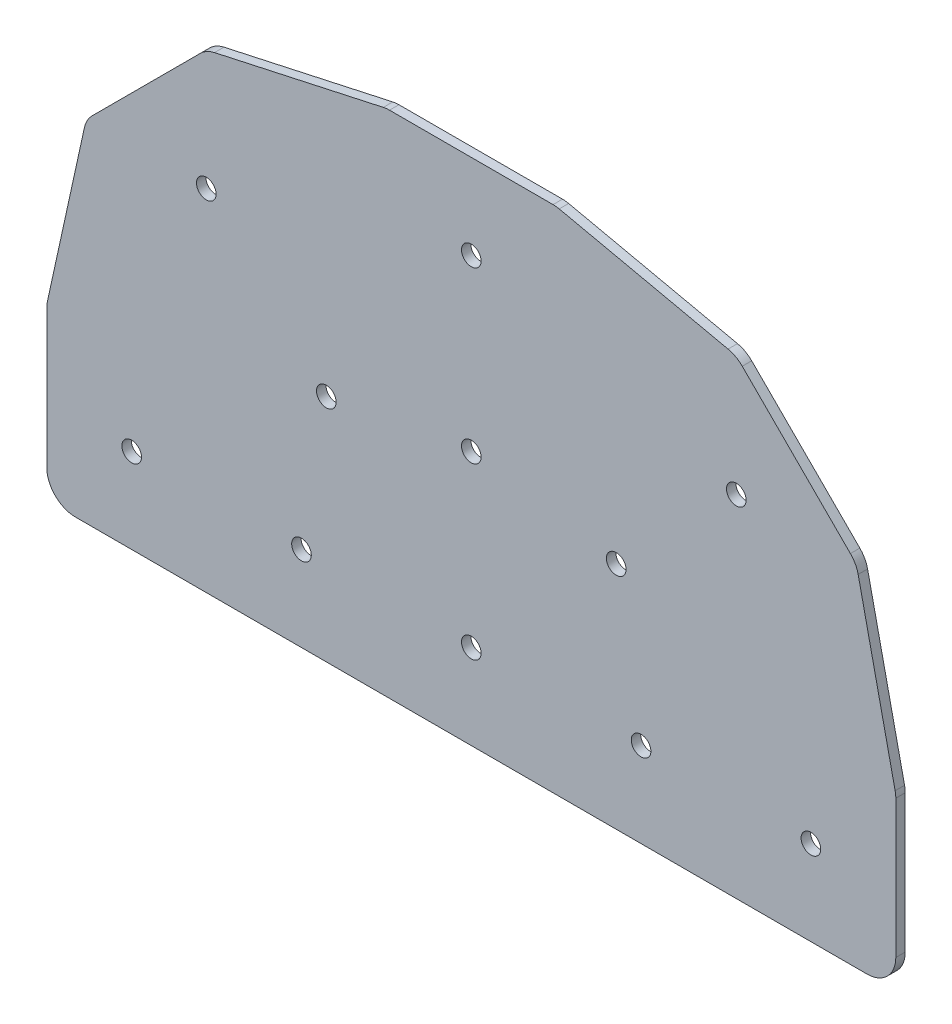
ISO-10303-21;
HEADER;
FILE_DESCRIPTION(('STEP AP214'),'2;1');
FILE_NAME('part.step','',(''),(''),'','','');
FILE_SCHEMA(('AUTOMOTIVE_DESIGN { 1 0 10303 214 1 1 1 1 }'));
ENDSEC;
DATA;
#1=APPLICATION_CONTEXT('core data for automotive mechanical design processes');
#2=APPLICATION_PROTOCOL_DEFINITION('international standard','automotive_design',2000,#1);
#3=PRODUCT_CONTEXT('',#1,'mechanical');
#4=PRODUCT('Part','Part','',(#3));
#5=PRODUCT_RELATED_PRODUCT_CATEGORY('part','',(#4));
#6=PRODUCT_DEFINITION_FORMATION('','',#4);
#7=PRODUCT_DEFINITION_CONTEXT('part definition',#1,'design');
#8=PRODUCT_DEFINITION('design','',#6,#7);
#9=PRODUCT_DEFINITION_SHAPE('','',#8);
#10=(LENGTH_UNIT() NAMED_UNIT(*) SI_UNIT(.MILLI.,.METRE.));
#11=(NAMED_UNIT(*) PLANE_ANGLE_UNIT() SI_UNIT($,.RADIAN.));
#12=(NAMED_UNIT(*) SI_UNIT($,.STERADIAN.) SOLID_ANGLE_UNIT());
#13=UNCERTAINTY_MEASURE_WITH_UNIT(LENGTH_MEASURE(1.E-05),#10,'distance_accuracy_value','');
#14=(GEOMETRIC_REPRESENTATION_CONTEXT(3) GLOBAL_UNCERTAINTY_ASSIGNED_CONTEXT((#13)) GLOBAL_UNIT_ASSIGNED_CONTEXT((#10,
#11,#12)) REPRESENTATION_CONTEXT('',''));
#15=CARTESIAN_POINT('',(0.,0.,0.));
#16=DIRECTION('',(0.,0.,1.));
#17=DIRECTION('',(1.,0.,0.));
#18=AXIS2_PLACEMENT_3D('',#15,#16,#17);
#19=CARTESIAN_POINT('',(-66.595625,0.,0.));
#20=DIRECTION('',(0.,1.,0.));
#21=DIRECTION('',(0.,0.,1.));
#22=AXIS2_PLACEMENT_3D('',#19,#20,#21);
#23=PLANE('',#22);
#24=DIRECTION('',(0.,0.,-1.));
#25=VECTOR('',#24,1.);
#26=CARTESIAN_POINT('',(66.5956250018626,0.,0.79375));
#27=LINE('',#26,#25);
#28=CARTESIAN_POINT('',(66.5956250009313,0.,0.));
#29=VERTEX_POINT('',#28);
#30=CARTESIAN_POINT('',(66.5956250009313,0.,1.5875));
#31=VERTEX_POINT('',#30);
#32=EDGE_CURVE('E231',#29,#31,#27,.F.);
#33=ORIENTED_EDGE('',*,*,#32,.T.);
#34=DIRECTION('',(1.,0.,0.));
#35=VECTOR('',#34,1.);
#36=CARTESIAN_POINT('',(0.,0.,1.5875));
#37=LINE('',#36,#35);
#38=CARTESIAN_POINT('',(-66.5956249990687,0.,1.5875));
#39=VERTEX_POINT('',#38);
#40=EDGE_CURVE('E299',#39,#31,#37,.T.);
#41=ORIENTED_EDGE('',*,*,#40,.F.);
#42=DIRECTION('',(0.,0.,1.));
#43=VECTOR('',#42,1.);
#44=CARTESIAN_POINT('',(-66.5956249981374,0.,0.79375));
#45=LINE('',#44,#43);
#46=CARTESIAN_POINT('',(-66.5956249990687,0.,0.));
#47=VERTEX_POINT('',#46);
#48=EDGE_CURVE('E177',#39,#47,#45,.F.);
#49=ORIENTED_EDGE('',*,*,#48,.T.);
#50=DIRECTION('',(1.,0.,0.));
#51=VECTOR('',#50,1.);
#52=CARTESIAN_POINT('',(0.,0.,0.));
#53=LINE('',#52,#51);
#54=EDGE_CURVE('E334',#47,#29,#53,.T.);
#55=ORIENTED_EDGE('',*,*,#54,.T.);
#56=EDGE_LOOP('',(#33,#41,#49,#55));
#57=FACE_BOUND('',#56,.T.);
#58=ADVANCED_FACE('F15',(#57),#23,.F.);
#59=CARTESIAN_POINT('',(66.595625,4.841875,1.5875));
#60=DIRECTION('',(0.,0.,-1.));
#61=DIRECTION('',(0.,1.,0.));
#62=AXIS2_PLACEMENT_3D('',#59,#60,#61);
#63=CYLINDRICAL_SURFACE('',#62,4.84187500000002);
#64=ORIENTED_EDGE('',*,*,#32,.F.);
#65=CARTESIAN_POINT('',(66.595625,4.841875,0.));
#66=DIRECTION('',(0.,0.,-1.));
#67=DIRECTION('',(0.,1.,0.));
#68=AXIS2_PLACEMENT_3D('',#65,#66,#67);
#69=CIRCLE('',#68,4.84187500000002);
#70=CARTESIAN_POINT('',(71.4375,4.841875,0.));
#71=VERTEX_POINT('',#70);
#72=EDGE_CURVE('E331',#29,#71,#69,.F.);
#73=ORIENTED_EDGE('',*,*,#72,.T.);
#74=DIRECTION('',(0.,0.,1.));
#75=VECTOR('',#74,1.);
#76=CARTESIAN_POINT('',(71.4375,4.841875,0.79375));
#77=LINE('',#76,#75);
#78=CARTESIAN_POINT('',(71.4375,4.841875,1.5875));
#79=VERTEX_POINT('',#78);
#80=EDGE_CURVE('E228',#71,#79,#77,.T.);
#81=ORIENTED_EDGE('',*,*,#80,.T.);
#82=CARTESIAN_POINT('',(66.595625,4.841875,1.5875));
#83=DIRECTION('',(0.,0.,-1.));
#84=DIRECTION('',(0.,1.,0.));
#85=AXIS2_PLACEMENT_3D('',#82,#83,#84);
#86=CIRCLE('',#85,4.84187500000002);
#87=EDGE_CURVE('E297',#31,#79,#86,.F.);
#88=ORIENTED_EDGE('',*,*,#87,.F.);
#89=EDGE_LOOP('',(#64,#73,#81,#88));
#90=FACE_BOUND('',#89,.T.);
#91=ADVANCED_FACE('F513',(#90),#63,.T.);
#92=CARTESIAN_POINT('',(71.4375,28.0511372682,0.));
#93=DIRECTION('',(-1.,0.,0.));
#94=DIRECTION('',(0.,-1.,0.));
#95=AXIS2_PLACEMENT_3D('',#92,#93,#94);
#96=PLANE('',#95);
#97=ORIENTED_EDGE('',*,*,#80,.F.);
#98=DIRECTION('',(0.,1.,0.));
#99=VECTOR('',#98,1.);
#100=CARTESIAN_POINT('',(71.4375,42.8625,0.));
#101=LINE('',#100,#99);
#102=CARTESIAN_POINT('',(71.4375,28.0511372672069,0.));
#103=VERTEX_POINT('',#102);
#104=EDGE_CURVE('E330',#71,#103,#101,.T.);
#105=ORIENTED_EDGE('',*,*,#104,.T.);
#106=DIRECTION('',(0.,0.,-1.));
#107=VECTOR('',#106,1.);
#108=CARTESIAN_POINT('',(71.4375,28.0511372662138,0.79375));
#109=LINE('',#108,#107);
#110=CARTESIAN_POINT('',(71.4375,28.0511372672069,1.5875));
#111=VERTEX_POINT('',#110);
#112=EDGE_CURVE('E151',#103,#111,#109,.F.);
#113=ORIENTED_EDGE('',*,*,#112,.T.);
#114=DIRECTION('',(0.,1.,0.));
#115=VECTOR('',#114,1.);
#116=CARTESIAN_POINT('',(71.4375,42.8625,1.5875));
#117=LINE('',#116,#115);
#118=EDGE_CURVE('E296',#79,#111,#117,.T.);
#119=ORIENTED_EDGE('',*,*,#118,.F.);
#120=EDGE_LOOP('',(#97,#105,#113,#119));
#121=FACE_BOUND('',#120,.T.);
#122=ADVANCED_FACE('F380',(#121),#96,.F.);
#123=CARTESIAN_POINT('',(66.595625,28.0511372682,1.5875));
#124=DIRECTION('',(0.,0.,-1.));
#125=DIRECTION('',(0.,1.,0.));
#126=AXIS2_PLACEMENT_3D('',#123,#124,#125);
#127=CYLINDRICAL_SURFACE('',#126,4.84187500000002);
#128=ORIENTED_EDGE('',*,*,#112,.F.);
#129=CARTESIAN_POINT('',(66.595625,28.0511372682,0.));
#130=DIRECTION('',(0.,0.,-1.));
#131=DIRECTION('',(0.,1.,0.));
#132=AXIS2_PLACEMENT_3D('',#129,#130,#131);
#133=CIRCLE('',#132,4.84187500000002);
#134=CARTESIAN_POINT('',(71.3254537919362,29.0867399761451,0.));
#135=VERTEX_POINT('',#134);
#136=EDGE_CURVE('E19',#103,#135,#133,.F.);
#137=ORIENTED_EDGE('',*,*,#136,.T.);
#138=DIRECTION('',(0.,0.,1.));
#139=VECTOR('',#138,1.);
#140=CARTESIAN_POINT('',(71.3254537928,29.0867399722,0.79375));
#141=LINE('',#140,#139);
#142=CARTESIAN_POINT('',(71.3254538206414,29.0867399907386,1.5875));
#143=VERTEX_POINT('',#142);
#144=EDGE_CURVE('E158',#135,#143,#141,.T.);
#145=ORIENTED_EDGE('',*,*,#144,.T.);
#146=CARTESIAN_POINT('',(66.595625,28.0511372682,1.5875));
#147=DIRECTION('',(0.,0.,-1.));
#148=DIRECTION('',(0.,1.,0.));
#149=AXIS2_PLACEMENT_3D('',#146,#147,#148);
#150=CIRCLE('',#149,4.84187500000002);
#151=EDGE_CURVE('E294',#111,#143,#150,.F.);
#152=ORIENTED_EDGE('',*,*,#151,.F.);
#153=EDGE_LOOP('',(#128,#137,#145,#152));
#154=FACE_BOUND('',#153,.T.);
#155=ADVANCED_FACE('F175',(#154),#127,.T.);
#156=CARTESIAN_POINT('',(65.1047616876,57.4980296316,0.));
#157=DIRECTION('',(-0.976858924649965,-0.213884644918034,0.));
#158=DIRECTION('',(0.213884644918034,-0.976858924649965,0.));
#159=AXIS2_PLACEMENT_3D('',#156,#157,#158);
#160=PLANE('',#159);
#161=ORIENTED_EDGE('',*,*,#144,.F.);
#162=DIRECTION('',(0.213884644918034,-0.976858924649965,0.));
#163=VECTOR('',#162,1.);
#164=CARTESIAN_POINT('',(65.1047616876,57.4980296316,0.));
#165=LINE('',#164,#163);
#166=CARTESIAN_POINT('',(65.1047616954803,57.4980296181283,0.));
#167=VERTEX_POINT('',#166);
#168=EDGE_CURVE('E162',#135,#167,#165,.F.);
#169=ORIENTED_EDGE('',*,*,#168,.T.);
#170=DIRECTION('',(0.,0.,-1.));
#171=VECTOR('',#170,1.);
#172=CARTESIAN_POINT('',(65.1047616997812,57.4980296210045,0.79375));
#173=LINE('',#172,#171);
#174=CARTESIAN_POINT('',(65.1047616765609,57.4980296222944,1.5875));
#175=VERTEX_POINT('',#174);
#176=EDGE_CURVE('E164',#167,#175,#173,.F.);
#177=ORIENTED_EDGE('',*,*,#176,.T.);
#178=DIRECTION('',(-0.213884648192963,0.976858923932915,0.));
#179=VECTOR('',#178,1.);
#180=CARTESIAN_POINT('',(71.325453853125,29.086739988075,1.5875));
#181=LINE('',#180,#179);
#182=EDGE_CURVE('E163',#143,#175,#181,.T.);
#183=ORIENTED_EDGE('',*,*,#182,.F.);
#184=EDGE_LOOP('',(#161,#169,#177,#183));
#185=FACE_BOUND('',#184,.T.);
#186=ADVANCED_FACE('F160',(#185),#160,.F.);
#187=CARTESIAN_POINT('',(60.3749328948,56.4624269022,1.5875));
#188=DIRECTION('',(0.,0.,-1.));
#189=DIRECTION('',(0.,1.,0.));
#190=AXIS2_PLACEMENT_3D('',#187,#188,#189);
#191=CYLINDRICAL_SURFACE('',#190,4.84187499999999);
#192=ORIENTED_EDGE('',*,*,#176,.F.);
#193=CARTESIAN_POINT('',(60.3749328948,56.4624269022,0.));
#194=DIRECTION('',(0.,0.,-1.));
#195=DIRECTION('',(0.,1.,0.));
#196=AXIS2_PLACEMENT_3D('',#193,#194,#195);
#197=CIRCLE('',#196,4.84187499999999);
#198=CARTESIAN_POINT('',(63.7986555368,59.8861495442,0.));
#199=VERTEX_POINT('',#198);
#200=EDGE_CURVE('E174',#167,#199,#197,.F.);
#201=ORIENTED_EDGE('',*,*,#200,.T.);
#202=DIRECTION('',(0.,0.,1.));
#203=VECTOR('',#202,1.);
#204=CARTESIAN_POINT('',(63.7986555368,59.8861495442,0.79375));
#205=LINE('',#204,#203);
#206=CARTESIAN_POINT('',(63.7986555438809,59.8861495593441,1.5875));
#207=VERTEX_POINT('',#206);
#208=EDGE_CURVE('E223',#199,#207,#205,.T.);
#209=ORIENTED_EDGE('',*,*,#208,.T.);
#210=CARTESIAN_POINT('',(60.3749328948,56.4624269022,1.5875));
#211=DIRECTION('',(0.,0.,-1.));
#212=DIRECTION('',(0.,1.,0.));
#213=AXIS2_PLACEMENT_3D('',#210,#211,#212);
#214=CIRCLE('',#213,4.84187499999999);
#215=EDGE_CURVE('E291',#175,#207,#214,.F.);
#216=ORIENTED_EDGE('',*,*,#215,.F.);
#217=EDGE_LOOP('',(#192,#201,#209,#216));
#218=FACE_BOUND('',#217,.T.);
#219=ADVANCED_FACE('F373',(#218),#191,.T.);
#220=CARTESIAN_POINT('',(45.5986495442,78.0861555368,0.));
#221=DIRECTION('',(-0.707106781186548,-0.707106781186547,0.));
#222=DIRECTION('',(0.707106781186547,-0.707106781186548,0.));
#223=AXIS2_PLACEMENT_3D('',#220,#221,#222);
#224=PLANE('',#223);
#225=ORIENTED_EDGE('',*,*,#208,.F.);
#226=DIRECTION('',(0.707106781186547,-0.707106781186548,0.));
#227=VECTOR('',#226,1.);
#228=CARTESIAN_POINT('',(45.5986495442,78.0861555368,0.));
#229=LINE('',#228,#227);
#230=CARTESIAN_POINT('',(45.5986495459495,78.0861555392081,0.));
#231=VERTEX_POINT('',#230);
#232=EDGE_CURVE('E369',#199,#231,#229,.F.);
#233=ORIENTED_EDGE('',*,*,#232,.T.);
#234=DIRECTION('',(0.,0.,-1.));
#235=VECTOR('',#234,1.);
#236=CARTESIAN_POINT('',(45.5986495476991,78.0861555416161,0.79375));
#237=LINE('',#236,#235);
#238=CARTESIAN_POINT('',(45.5986495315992,78.0861555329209,1.5875));
#239=VERTEX_POINT('',#238);
#240=EDGE_CURVE('E220',#231,#239,#237,.F.);
#241=ORIENTED_EDGE('',*,*,#240,.T.);
#242=DIRECTION('',(-0.707106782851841,0.707106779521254,0.));
#243=VECTOR('',#242,1.);
#244=CARTESIAN_POINT('',(63.7986555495,59.88614957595,1.5875));
#245=LINE('',#244,#243);
#246=EDGE_CURVE('E289',#207,#239,#245,.T.);
#247=ORIENTED_EDGE('',*,*,#246,.F.);
#248=EDGE_LOOP('',(#225,#233,#241,#247));
#249=FACE_BOUND('',#248,.T.);
#250=ADVANCED_FACE('F435',(#249),#224,.F.);
#251=CARTESIAN_POINT('',(42.1749269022,74.6624328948,1.5875));
#252=DIRECTION('',(0.,0.,-1.));
#253=DIRECTION('',(0.,1.,0.));
#254=AXIS2_PLACEMENT_3D('',#251,#252,#253);
#255=CYLINDRICAL_SURFACE('',#254,4.841875);
#256=ORIENTED_EDGE('',*,*,#240,.F.);
#257=CARTESIAN_POINT('',(42.1749269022,74.6624328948,0.));
#258=DIRECTION('',(0.,0.,-1.));
#259=DIRECTION('',(0.,1.,0.));
#260=AXIS2_PLACEMENT_3D('',#257,#258,#259);
#261=CIRCLE('',#260,4.841875);
#262=CARTESIAN_POINT('',(43.2105296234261,79.3922616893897,0.));
#263=VERTEX_POINT('',#262);
#264=EDGE_CURVE('E366',#231,#263,#261,.F.);
#265=ORIENTED_EDGE('',*,*,#264,.T.);
#266=DIRECTION('',(0.,0.,1.));
#267=VECTOR('',#266,1.);
#268=CARTESIAN_POINT('',(43.2105296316,79.3922616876,0.79375));
#269=LINE('',#268,#267);
#270=CARTESIAN_POINT('',(43.2105296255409,79.3922616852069,1.5875));
#271=VERTEX_POINT('',#270);
#272=EDGE_CURVE('E217',#263,#271,#269,.T.);
#273=ORIENTED_EDGE('',*,*,#272,.T.);
#274=CARTESIAN_POINT('',(42.1749269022,74.6624328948,1.5875));
#275=DIRECTION('',(0.,0.,-1.));
#276=DIRECTION('',(0.,1.,0.));
#277=AXIS2_PLACEMENT_3D('',#274,#275,#276);
#278=CIRCLE('',#277,4.841875);
#279=EDGE_CURVE('E287',#239,#271,#278,.F.);
#280=ORIENTED_EDGE('',*,*,#279,.F.);
#281=EDGE_LOOP('',(#256,#265,#273,#280));
#282=FACE_BOUND('',#281,.T.);
#283=ADVANCED_FACE('F432',(#282),#255,.T.);
#284=CARTESIAN_POINT('',(14.7992399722,85.6129537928,0.));
#285=DIRECTION('',(-0.213884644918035,-0.976858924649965,0.));
#286=DIRECTION('',(0.976858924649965,-0.213884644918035,0.));
#287=AXIS2_PLACEMENT_3D('',#284,#285,#286);
#288=PLANE('',#287);
#289=ORIENTED_EDGE('',*,*,#272,.F.);
#290=DIRECTION('',(0.976858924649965,-0.213884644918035,0.));
#291=VECTOR('',#290,1.);
#292=CARTESIAN_POINT('',(14.7992399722,85.6129537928,0.));
#293=LINE('',#292,#291);
#294=CARTESIAN_POINT('',(14.7992399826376,85.612953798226,0.));
#295=VERTEX_POINT('',#294);
#296=EDGE_CURVE('E363',#263,#295,#293,.F.);
#297=ORIENTED_EDGE('',*,*,#296,.T.);
#298=DIRECTION('',(0.,0.,-1.));
#299=VECTOR('',#298,1.);
#300=CARTESIAN_POINT('',(14.799239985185,85.6129538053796,0.79375));
#301=LINE('',#300,#299);
#302=CARTESIAN_POINT('',(14.7992399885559,85.6129538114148,1.5875));
#303=VERTEX_POINT('',#302);
#304=EDGE_CURVE('E214',#295,#303,#301,.F.);
#305=ORIENTED_EDGE('',*,*,#304,.T.);
#306=DIRECTION('',(-0.976858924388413,0.213884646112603,0.));
#307=VECTOR('',#306,1.);
#308=CARTESIAN_POINT('',(43.210529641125,79.392261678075,1.5875));
#309=LINE('',#308,#307);
#310=EDGE_CURVE('E285',#271,#303,#309,.T.);
#311=ORIENTED_EDGE('',*,*,#310,.F.);
#312=EDGE_LOOP('',(#289,#297,#305,#311));
#313=FACE_BOUND('',#312,.T.);
#314=ADVANCED_FACE('F429',(#313),#288,.F.);
#315=CARTESIAN_POINT('',(13.7636372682,80.883125,1.5875));
#316=DIRECTION('',(0.,0.,-1.));
#317=DIRECTION('',(0.,1.,0.));
#318=AXIS2_PLACEMENT_3D('',#315,#316,#317);
#319=CYLINDRICAL_SURFACE('',#318,4.841875);
#320=ORIENTED_EDGE('',*,*,#304,.F.);
#321=CARTESIAN_POINT('',(13.7636372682,80.883125,0.));
#322=DIRECTION('',(0.,0.,-1.));
#323=DIRECTION('',(0.,1.,0.));
#324=AXIS2_PLACEMENT_3D('',#321,#322,#323);
#325=CIRCLE('',#324,4.841875);
#326=CARTESIAN_POINT('',(13.7636372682,85.725,0.));
#327=VERTEX_POINT('',#326);
#328=EDGE_CURVE('E360',#295,#327,#325,.F.);
#329=ORIENTED_EDGE('',*,*,#328,.T.);
#330=DIRECTION('',(0.,0.,1.));
#331=VECTOR('',#330,1.);
#332=CARTESIAN_POINT('',(13.7636372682,85.725,0.79375));
#333=LINE('',#332,#331);
#334=CARTESIAN_POINT('',(13.7636372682,85.725,1.5875));
#335=VERTEX_POINT('',#334);
#336=EDGE_CURVE('E211',#327,#335,#333,.T.);
#337=ORIENTED_EDGE('',*,*,#336,.T.);
#338=CARTESIAN_POINT('',(13.7636372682,80.883125,1.5875));
#339=DIRECTION('',(0.,0.,-1.));
#340=DIRECTION('',(0.,1.,0.));
#341=AXIS2_PLACEMENT_3D('',#338,#339,#340);
#342=CIRCLE('',#341,4.841875);
#343=EDGE_CURVE('E283',#303,#335,#342,.F.);
#344=ORIENTED_EDGE('',*,*,#343,.F.);
#345=EDGE_LOOP('',(#320,#329,#337,#344));
#346=FACE_BOUND('',#345,.T.);
#347=ADVANCED_FACE('F425',(#346),#319,.T.);
#348=CARTESIAN_POINT('',(-13.7636372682,85.725,0.));
#349=DIRECTION('',(0.,-1.,0.));
#350=DIRECTION('',(1.,0.,0.));
#351=AXIS2_PLACEMENT_3D('',#348,#349,#350);
#352=PLANE('',#351);
#353=ORIENTED_EDGE('',*,*,#336,.F.);
#354=DIRECTION('',(-1.,0.,0.));
#355=VECTOR('',#354,1.);
#356=CARTESIAN_POINT('',(0.,85.725,0.));
#357=LINE('',#356,#355);
#358=CARTESIAN_POINT('',(-13.7636372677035,85.725,0.));
#359=VERTEX_POINT('',#358);
#360=EDGE_CURVE('E185',#327,#359,#357,.T.);
#361=ORIENTED_EDGE('',*,*,#360,.T.);
#362=DIRECTION('',(0.,0.,-1.));
#363=VECTOR('',#362,1.);
#364=CARTESIAN_POINT('',(-13.7636372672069,85.725,0.79375));
#365=LINE('',#364,#363);
#366=CARTESIAN_POINT('',(-13.7636372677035,85.725,1.5875));
#367=VERTEX_POINT('',#366);
#368=EDGE_CURVE('E208',#359,#367,#365,.F.);
#369=ORIENTED_EDGE('',*,*,#368,.T.);
#370=DIRECTION('',(-1.,0.,0.));
#371=VECTOR('',#370,1.);
#372=CARTESIAN_POINT('',(0.,85.725,1.5875));
#373=LINE('',#372,#371);
#374=EDGE_CURVE('E282',#335,#367,#373,.T.);
#375=ORIENTED_EDGE('',*,*,#374,.F.);
#376=EDGE_LOOP('',(#353,#361,#369,#375));
#377=FACE_BOUND('',#376,.T.);
#378=ADVANCED_FACE('F421',(#377),#352,.F.);
#379=CARTESIAN_POINT('',(-13.7636372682,80.883125,1.5875));
#380=DIRECTION('',(0.,0.,-1.));
#381=DIRECTION('',(0.,1.,0.));
#382=AXIS2_PLACEMENT_3D('',#379,#380,#381);
#383=CYLINDRICAL_SURFACE('',#382,4.841875);
#384=ORIENTED_EDGE('',*,*,#368,.F.);
#385=CARTESIAN_POINT('',(-13.7636372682,80.883125,0.));
#386=DIRECTION('',(0.,0.,-1.));
#387=DIRECTION('',(0.,1.,0.));
#388=AXIS2_PLACEMENT_3D('',#385,#386,#387);
#389=CIRCLE('',#388,4.841875);
#390=CARTESIAN_POINT('',(-14.7992399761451,85.6129537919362,0.));
#391=VERTEX_POINT('',#390);
#392=EDGE_CURVE('E357',#359,#391,#389,.F.);
#393=ORIENTED_EDGE('',*,*,#392,.T.);
#394=DIRECTION('',(0.,0.,1.));
#395=VECTOR('',#394,1.);
#396=CARTESIAN_POINT('',(-14.7992399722,85.6129537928,0.79375));
#397=LINE('',#396,#395);
#398=CARTESIAN_POINT('',(-14.7992399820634,85.6129538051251,1.5875));
#399=VERTEX_POINT('',#398);
#400=EDGE_CURVE('E205',#391,#399,#397,.T.);
#401=ORIENTED_EDGE('',*,*,#400,.T.);
#402=CARTESIAN_POINT('',(-13.7636372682,80.883125,1.5875));
#403=DIRECTION('',(0.,0.,-1.));
#404=DIRECTION('',(0.,1.,0.));
#405=AXIS2_PLACEMENT_3D('',#402,#403,#404);
#406=CIRCLE('',#405,4.841875);
#407=EDGE_CURVE('E280',#367,#399,#406,.F.);
#408=ORIENTED_EDGE('',*,*,#407,.F.);
#409=EDGE_LOOP('',(#384,#393,#401,#408));
#410=FACE_BOUND('',#409,.T.);
#411=ADVANCED_FACE('F417',(#410),#383,.T.);
#412=CARTESIAN_POINT('',(-43.2105296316,79.3922616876,0.));
#413=DIRECTION('',(0.213884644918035,-0.976858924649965,0.));
#414=DIRECTION('',(0.976858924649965,0.213884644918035,0.));
#415=AXIS2_PLACEMENT_3D('',#412,#413,#414);
#416=PLANE('',#415);
#417=ORIENTED_EDGE('',*,*,#400,.F.);
#418=DIRECTION('',(0.976858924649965,0.213884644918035,0.));
#419=VECTOR('',#418,1.);
#420=CARTESIAN_POINT('',(-43.2105296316,79.3922616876,0.));
#421=LINE('',#420,#419);
#422=CARTESIAN_POINT('',(-43.2105296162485,79.3922616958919,0.));
#423=VERTEX_POINT('',#422);
#424=EDGE_CURVE('E354',#391,#423,#421,.F.);
#425=ORIENTED_EDGE('',*,*,#424,.T.);
#426=DIRECTION('',(0.,0.,-1.));
#427=VECTOR('',#426,1.);
#428=CARTESIAN_POINT('',(-43.2105296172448,79.3922617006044,0.79375));
#429=LINE('',#428,#427);
#430=CARTESIAN_POINT('',(-43.2105296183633,79.3922616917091,1.5875));
#431=VERTEX_POINT('',#430);
#432=EDGE_CURVE('E202',#423,#431,#429,.F.);
#433=ORIENTED_EDGE('',*,*,#432,.T.);
#434=DIRECTION('',(-0.976858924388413,-0.213884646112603,0.));
#435=VECTOR('',#434,1.);
#436=CARTESIAN_POINT('',(-14.7992399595,85.61295382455,1.5875));
#437=LINE('',#436,#435);
#438=EDGE_CURVE('E278',#399,#431,#437,.T.);
#439=ORIENTED_EDGE('',*,*,#438,.F.);
#440=EDGE_LOOP('',(#417,#425,#433,#439));
#441=FACE_BOUND('',#440,.T.);
#442=ADVANCED_FACE('F412',(#441),#416,.F.);
#443=CARTESIAN_POINT('',(-42.1749269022,74.6624328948,1.5875));
#444=DIRECTION('',(0.,0.,-1.));
#445=DIRECTION('',(0.,1.,0.));
#446=AXIS2_PLACEMENT_3D('',#443,#444,#445);
#447=CYLINDRICAL_SURFACE('',#446,4.841875);
#448=ORIENTED_EDGE('',*,*,#432,.F.);
#449=CARTESIAN_POINT('',(-42.1749269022,74.6624328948,0.));
#450=DIRECTION('',(0.,0.,-1.));
#451=DIRECTION('',(0.,1.,0.));
#452=AXIS2_PLACEMENT_3D('',#449,#450,#451);
#453=CIRCLE('',#452,4.841875);
#454=CARTESIAN_POINT('',(-45.5986495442,78.0861555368,0.));
#455=VERTEX_POINT('',#454);
#456=EDGE_CURVE('E351',#423,#455,#453,.F.);
#457=ORIENTED_EDGE('',*,*,#456,.T.);
#458=DIRECTION('',(0.,0.,1.));
#459=VECTOR('',#458,1.);
#460=CARTESIAN_POINT('',(-45.5986495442,78.0861555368,0.79375));
#461=LINE('',#460,#459);
#462=CARTESIAN_POINT('',(-45.5986495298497,78.0861555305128,1.5875));
#463=VERTEX_POINT('',#462);
#464=EDGE_CURVE('E199',#455,#463,#461,.T.);
#465=ORIENTED_EDGE('',*,*,#464,.T.);
#466=CARTESIAN_POINT('',(-42.1749269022,74.6624328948,1.5875));
#467=DIRECTION('',(0.,0.,-1.));
#468=DIRECTION('',(0.,1.,0.));
#469=AXIS2_PLACEMENT_3D('',#466,#467,#468);
#470=CIRCLE('',#469,4.841875);
#471=EDGE_CURVE('E276',#431,#463,#470,.F.);
#472=ORIENTED_EDGE('',*,*,#471,.F.);
#473=EDGE_LOOP('',(#448,#457,#465,#472));
#474=FACE_BOUND('',#473,.T.);
#475=ADVANCED_FACE('F408',(#474),#447,.T.);
#476=CARTESIAN_POINT('',(-63.7986555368,59.8861495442,0.));
#477=DIRECTION('',(0.707106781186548,-0.707106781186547,0.));
#478=DIRECTION('',(0.707106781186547,0.707106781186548,0.));
#479=AXIS2_PLACEMENT_3D('',#476,#477,#478);
#480=PLANE('',#479);
#481=ORIENTED_EDGE('',*,*,#464,.F.);
#482=DIRECTION('',(0.707106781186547,0.707106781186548,0.));
#483=VECTOR('',#482,1.);
#484=CARTESIAN_POINT('',(-63.7986555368,59.8861495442,0.));
#485=LINE('',#484,#483);
#486=CARTESIAN_POINT('',(-63.7986555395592,59.8861495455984,0.));
#487=VERTEX_POINT('',#486);
#488=EDGE_CURVE('E348',#455,#487,#485,.F.);
#489=ORIENTED_EDGE('',*,*,#488,.T.);
#490=DIRECTION('',(0.,0.,-1.));
#491=VECTOR('',#490,1.);
#492=CARTESIAN_POINT('',(-63.7986555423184,59.8861495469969,0.79375));
#493=LINE('',#492,#491);
#494=CARTESIAN_POINT('',(-63.7986555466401,59.8861495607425,1.5875));
#495=VERTEX_POINT('',#494);
#496=EDGE_CURVE('E196',#487,#495,#493,.F.);
#497=ORIENTED_EDGE('',*,*,#496,.T.);
#498=DIRECTION('',(-0.707106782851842,-0.707106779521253,0.));
#499=VECTOR('',#498,1.);
#500=CARTESIAN_POINT('',(-45.598649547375,78.08615549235,1.5875));
#501=LINE('',#500,#499);
#502=EDGE_CURVE('E274',#463,#495,#501,.T.);
#503=ORIENTED_EDGE('',*,*,#502,.F.);
#504=EDGE_LOOP('',(#481,#489,#497,#503));
#505=FACE_BOUND('',#504,.T.);
#506=ADVANCED_FACE('F404',(#505),#480,.F.);
#507=CARTESIAN_POINT('',(-60.3749328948,56.4624269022,1.5875));
#508=DIRECTION('',(0.,0.,-1.));
#509=DIRECTION('',(0.,1.,0.));
#510=AXIS2_PLACEMENT_3D('',#507,#508,#509);
#511=CYLINDRICAL_SURFACE('',#510,4.84187500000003);
#512=ORIENTED_EDGE('',*,*,#496,.F.);
#513=CARTESIAN_POINT('',(-60.3749328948,56.4624269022,0.));
#514=DIRECTION('',(0.,0.,-1.));
#515=DIRECTION('',(0.,1.,0.));
#516=AXIS2_PLACEMENT_3D('',#513,#514,#515);
#517=CIRCLE('',#516,4.84187500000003);
#518=CARTESIAN_POINT('',(-65.1047616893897,57.4980296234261,0.));
#519=VERTEX_POINT('',#518);
#520=EDGE_CURVE('E345',#487,#519,#517,.F.);
#521=ORIENTED_EDGE('',*,*,#520,.T.);
#522=DIRECTION('',(0.,0.,1.));
#523=VECTOR('',#522,1.);
#524=CARTESIAN_POINT('',(-65.1047616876,57.4980296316,0.79375));
#525=LINE('',#524,#523);
#526=CARTESIAN_POINT('',(-65.1047616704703,57.4980296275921,1.5875));
#527=VERTEX_POINT('',#526);
#528=EDGE_CURVE('E193',#519,#527,#525,.T.);
#529=ORIENTED_EDGE('',*,*,#528,.T.);
#530=CARTESIAN_POINT('',(-60.3749328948,56.4624269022,1.5875));
#531=DIRECTION('',(0.,0.,-1.));
#532=DIRECTION('',(0.,1.,0.));
#533=AXIS2_PLACEMENT_3D('',#530,#531,#532);
#534=CIRCLE('',#533,4.84187500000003);
#535=EDGE_CURVE('E272',#495,#527,#534,.F.);
#536=ORIENTED_EDGE('',*,*,#535,.F.);
#537=EDGE_LOOP('',(#512,#521,#529,#536));
#538=FACE_BOUND('',#537,.T.);
#539=ADVANCED_FACE('F400',(#538),#511,.T.);
#540=CARTESIAN_POINT('',(-71.3254537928,29.0867399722,0.));
#541=DIRECTION('',(0.976858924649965,-0.213884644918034,0.));
#542=DIRECTION('',(0.213884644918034,0.976858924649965,0.));
#543=AXIS2_PLACEMENT_3D('',#540,#541,#542);
#544=PLANE('',#543);
#545=ORIENTED_EDGE('',*,*,#528,.F.);
#546=DIRECTION('',(0.213884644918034,0.976858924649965,0.));
#547=VECTOR('',#546,1.);
#548=CARTESIAN_POINT('',(-71.3254537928,29.0867399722,0.));
#549=LINE('',#548,#547);
#550=CARTESIAN_POINT('',(-71.3254537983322,29.0867399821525,0.));
#551=VERTEX_POINT('',#550);
#552=EDGE_CURVE('E342',#519,#551,#549,.F.);
#553=ORIENTED_EDGE('',*,*,#552,.T.);
#554=DIRECTION('',(0.,0.,-1.));
#555=VECTOR('',#554,1.);
#556=CARTESIAN_POINT('',(-71.325453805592,29.0867399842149,0.79375));
#557=LINE('',#556,#555);
#558=CARTESIAN_POINT('',(-71.3254538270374,29.0867399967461,1.5875));
#559=VERTEX_POINT('',#558);
#560=EDGE_CURVE('E190',#551,#559,#557,.F.);
#561=ORIENTED_EDGE('',*,*,#560,.T.);
#562=DIRECTION('',(-0.213884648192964,-0.976858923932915,0.));
#563=VECTOR('',#562,1.);
#564=CARTESIAN_POINT('',(-65.1047616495,57.498029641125,1.5875));
#565=LINE('',#564,#563);
#566=EDGE_CURVE('E270',#527,#559,#565,.T.);
#567=ORIENTED_EDGE('',*,*,#566,.F.);
#568=EDGE_LOOP('',(#545,#553,#561,#567));
#569=FACE_BOUND('',#568,.T.);
#570=ADVANCED_FACE('F396',(#569),#544,.F.);
#571=CARTESIAN_POINT('',(-66.595625,28.0511372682,1.5875));
#572=DIRECTION('',(0.,0.,-1.));
#573=DIRECTION('',(0.,1.,0.));
#574=AXIS2_PLACEMENT_3D('',#571,#572,#573);
#575=CYLINDRICAL_SURFACE('',#574,4.841875);
#576=ORIENTED_EDGE('',*,*,#560,.F.);
#577=CARTESIAN_POINT('',(-66.595625,28.0511372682,0.));
#578=DIRECTION('',(0.,0.,-1.));
#579=DIRECTION('',(0.,1.,0.));
#580=AXIS2_PLACEMENT_3D('',#577,#578,#579);
#581=CIRCLE('',#580,4.841875);
#582=CARTESIAN_POINT('',(-71.4375,28.0511372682,0.));
#583=VERTEX_POINT('',#582);
#584=EDGE_CURVE('E339',#551,#583,#581,.F.);
#585=ORIENTED_EDGE('',*,*,#584,.T.);
#586=DIRECTION('',(0.,0.,1.));
#587=VECTOR('',#586,1.);
#588=CARTESIAN_POINT('',(-71.4375,28.0511372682,0.79375));
#589=LINE('',#588,#587);
#590=CARTESIAN_POINT('',(-71.4375,28.0511372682,1.5875));
#591=VERTEX_POINT('',#590);
#592=EDGE_CURVE('E182',#583,#591,#589,.T.);
#593=ORIENTED_EDGE('',*,*,#592,.T.);
#594=CARTESIAN_POINT('',(-66.595625,28.0511372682,1.5875));
#595=DIRECTION('',(0.,0.,-1.));
#596=DIRECTION('',(0.,1.,0.));
#597=AXIS2_PLACEMENT_3D('',#594,#595,#596);
#598=CIRCLE('',#597,4.841875);
#599=EDGE_CURVE('E268',#559,#591,#598,.F.);
#600=ORIENTED_EDGE('',*,*,#599,.F.);
#601=EDGE_LOOP('',(#576,#585,#593,#600));
#602=FACE_BOUND('',#601,.T.);
#603=ADVANCED_FACE('F392',(#602),#575,.T.);
#604=CARTESIAN_POINT('',(-71.4375,4.841875,0.));
#605=DIRECTION('',(1.,0.,0.));
#606=DIRECTION('',(0.,1.,0.));
#607=AXIS2_PLACEMENT_3D('',#604,#605,#606);
#608=PLANE('',#607);
#609=ORIENTED_EDGE('',*,*,#592,.F.);
#610=DIRECTION('',(0.,-1.,0.));
#611=VECTOR('',#610,1.);
#612=CARTESIAN_POINT('',(-71.4375,42.8625,0.));
#613=LINE('',#612,#611);
#614=CARTESIAN_POINT('',(-71.4375,4.84187499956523,0.));
#615=VERTEX_POINT('',#614);
#616=EDGE_CURVE('E338',#583,#615,#613,.T.);
#617=ORIENTED_EDGE('',*,*,#616,.T.);
#618=DIRECTION('',(0.,0.,-1.));
#619=VECTOR('',#618,1.);
#620=CARTESIAN_POINT('',(-71.4375,4.84187499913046,0.79375));
#621=LINE('',#620,#619);
#622=CARTESIAN_POINT('',(-71.4375,4.84187499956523,1.5875));
#623=VERTEX_POINT('',#622);
#624=EDGE_CURVE('E176',#615,#623,#621,.F.);
#625=ORIENTED_EDGE('',*,*,#624,.T.);
#626=DIRECTION('',(0.,-1.,0.));
#627=VECTOR('',#626,1.);
#628=CARTESIAN_POINT('',(-71.4375,42.8625,1.5875));
#629=LINE('',#628,#627);
#630=EDGE_CURVE('E34',#591,#623,#629,.T.);
#631=ORIENTED_EDGE('',*,*,#630,.F.);
#632=EDGE_LOOP('',(#609,#617,#625,#631));
#633=FACE_BOUND('',#632,.T.);
#634=ADVANCED_FACE('F386',(#633),#608,.F.);
#635=CARTESIAN_POINT('',(-66.595625,4.841875,1.5875));
#636=DIRECTION('',(0.,0.,-1.));
#637=DIRECTION('',(0.,1.,0.));
#638=AXIS2_PLACEMENT_3D('',#635,#636,#637);
#639=CYLINDRICAL_SURFACE('',#638,4.841875);
#640=ORIENTED_EDGE('',*,*,#624,.F.);
#641=CARTESIAN_POINT('',(-66.595625,4.841875,0.));
#642=DIRECTION('',(0.,0.,-1.));
#643=DIRECTION('',(0.,1.,0.));
#644=AXIS2_PLACEMENT_3D('',#641,#642,#643);
#645=CIRCLE('',#644,4.841875);
#646=EDGE_CURVE('E335',#615,#47,#645,.F.);
#647=ORIENTED_EDGE('',*,*,#646,.T.);
#648=ORIENTED_EDGE('',*,*,#48,.F.);
#649=CARTESIAN_POINT('',(-66.595625,4.841875,1.5875));
#650=DIRECTION('',(0.,0.,-1.));
#651=DIRECTION('',(0.,1.,0.));
#652=AXIS2_PLACEMENT_3D('',#649,#650,#651);
#653=CIRCLE('',#652,4.841875);
#654=EDGE_CURVE('E266',#623,#39,#653,.F.);
#655=ORIENTED_EDGE('',*,*,#654,.F.);
#656=EDGE_LOOP('',(#640,#647,#648,#655));
#657=FACE_BOUND('',#656,.T.);
#658=ADVANCED_FACE('F496',(#657),#639,.T.);
#659=CARTESIAN_POINT('',(0.,71.4375,0.));
#660=DIRECTION('',(0.,0.,1.));
#661=DIRECTION('',(1.,0.,0.));
#662=AXIS2_PLACEMENT_3D('',#659,#660,#661);
#663=CYLINDRICAL_SURFACE('',#662,1.651);
#664=CARTESIAN_POINT('',(0.,71.4375,1.5875));
#665=DIRECTION('',(0.,0.,1.));
#666=DIRECTION('',(1.,0.,0.));
#667=AXIS2_PLACEMENT_3D('',#664,#665,#666);
#668=CIRCLE('',#667,1.651);
#669=CARTESIAN_POINT('',(1.651,71.4375,1.5875));
#670=VERTEX_POINT('',#669);
#671=EDGE_CURVE('E263',#670,#670,#668,.F.);
#672=ORIENTED_EDGE('',*,*,#671,.F.);
#673=EDGE_LOOP('',(#672));
#674=FACE_BOUND('',#673,.T.);
#675=CARTESIAN_POINT('',(0.,71.4375,0.));
#676=DIRECTION('',(0.,0.,1.));
#677=DIRECTION('',(1.,0.,0.));
#678=AXIS2_PLACEMENT_3D('',#675,#676,#677);
#679=CIRCLE('',#678,1.651);
#680=CARTESIAN_POINT('',(1.651,71.4375,0.));
#681=VERTEX_POINT('',#680);
#682=EDGE_CURVE('E327',#681,#681,#679,.F.);
#683=ORIENTED_EDGE('',*,*,#682,.T.);
#684=EDGE_LOOP('',(#683));
#685=FACE_BOUND('',#684,.T.);
#686=ADVANCED_FACE('F492',(#674,#685),#663,.F.);
#687=CARTESIAN_POINT('',(0.,42.8625,0.));
#688=DIRECTION('',(0.,0.,1.));
#689=DIRECTION('',(1.,0.,0.));
#690=AXIS2_PLACEMENT_3D('',#687,#688,#689);
#691=CYLINDRICAL_SURFACE('',#690,1.651);
#692=CARTESIAN_POINT('',(0.,42.8625,1.5875));
#693=DIRECTION('',(0.,0.,1.));
#694=DIRECTION('',(1.,0.,0.));
#695=AXIS2_PLACEMENT_3D('',#692,#693,#694);
#696=CIRCLE('',#695,1.651);
#697=CARTESIAN_POINT('',(1.651,42.8625,1.5875));
#698=VERTEX_POINT('',#697);
#699=EDGE_CURVE('E260',#698,#698,#696,.F.);
#700=ORIENTED_EDGE('',*,*,#699,.F.);
#701=EDGE_LOOP('',(#700));
#702=FACE_BOUND('',#701,.T.);
#703=CARTESIAN_POINT('',(0.,42.8625,0.));
#704=DIRECTION('',(0.,0.,1.));
#705=DIRECTION('',(1.,0.,0.));
#706=AXIS2_PLACEMENT_3D('',#703,#704,#705);
#707=CIRCLE('',#706,1.651);
#708=CARTESIAN_POINT('',(1.651,42.8625,0.));
#709=VERTEX_POINT('',#708);
#710=EDGE_CURVE('E324',#709,#709,#707,.F.);
#711=ORIENTED_EDGE('',*,*,#710,.T.);
#712=EDGE_LOOP('',(#711));
#713=FACE_BOUND('',#712,.T.);
#714=ADVANCED_FACE('F488',(#702,#713),#691,.F.);
#715=CARTESIAN_POINT('',(-57.15,14.2875,0.));
#716=DIRECTION('',(0.,0.,1.));
#717=DIRECTION('',(1.,0.,0.));
#718=AXIS2_PLACEMENT_3D('',#715,#716,#717);
#719=CYLINDRICAL_SURFACE('',#718,1.651);
#720=CARTESIAN_POINT('',(-57.15,14.2875,1.5875));
#721=DIRECTION('',(0.,0.,1.));
#722=DIRECTION('',(1.,0.,0.));
#723=AXIS2_PLACEMENT_3D('',#720,#721,#722);
#724=CIRCLE('',#723,1.651);
#725=CARTESIAN_POINT('',(-55.499,14.2875,1.5875));
#726=VERTEX_POINT('',#725);
#727=EDGE_CURVE('E257',#726,#726,#724,.F.);
#728=ORIENTED_EDGE('',*,*,#727,.F.);
#729=EDGE_LOOP('',(#728));
#730=FACE_BOUND('',#729,.T.);
#731=CARTESIAN_POINT('',(-57.15,14.2875,0.));
#732=DIRECTION('',(0.,0.,1.));
#733=DIRECTION('',(1.,0.,0.));
#734=AXIS2_PLACEMENT_3D('',#731,#732,#733);
#735=CIRCLE('',#734,1.651);
#736=CARTESIAN_POINT('',(-55.499,14.2875,0.));
#737=VERTEX_POINT('',#736);
#738=EDGE_CURVE('E321',#737,#737,#735,.F.);
#739=ORIENTED_EDGE('',*,*,#738,.T.);
#740=EDGE_LOOP('',(#739));
#741=FACE_BOUND('',#740,.T.);
#742=ADVANCED_FACE('F484',(#730,#741),#719,.F.);
#743=CARTESIAN_POINT('',(57.15,14.2875,0.));
#744=DIRECTION('',(0.,0.,1.));
#745=DIRECTION('',(1.,0.,0.));
#746=AXIS2_PLACEMENT_3D('',#743,#744,#745);
#747=CYLINDRICAL_SURFACE('',#746,1.65099999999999);
#748=CARTESIAN_POINT('',(57.15,14.2875,1.5875));
#749=DIRECTION('',(0.,0.,1.));
#750=DIRECTION('',(1.,0.,0.));
#751=AXIS2_PLACEMENT_3D('',#748,#749,#750);
#752=CIRCLE('',#751,1.65099999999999);
#753=CARTESIAN_POINT('',(58.801,14.2875,1.5875));
#754=VERTEX_POINT('',#753);
#755=EDGE_CURVE('E254',#754,#754,#752,.F.);
#756=ORIENTED_EDGE('',*,*,#755,.F.);
#757=EDGE_LOOP('',(#756));
#758=FACE_BOUND('',#757,.T.);
#759=CARTESIAN_POINT('',(57.15,14.2875,0.));
#760=DIRECTION('',(0.,0.,1.));
#761=DIRECTION('',(1.,0.,0.));
#762=AXIS2_PLACEMENT_3D('',#759,#760,#761);
#763=CIRCLE('',#762,1.65099999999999);
#764=CARTESIAN_POINT('',(58.801,14.2875,0.));
#765=VERTEX_POINT('',#764);
#766=EDGE_CURVE('E318',#765,#765,#763,.F.);
#767=ORIENTED_EDGE('',*,*,#766,.T.);
#768=EDGE_LOOP('',(#767));
#769=FACE_BOUND('',#768,.T.);
#770=ADVANCED_FACE('F480',(#758,#769),#747,.F.);
#771=CARTESIAN_POINT('',(44.5958644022,58.8833644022,0.));
#772=DIRECTION('',(0.,0.,1.));
#773=DIRECTION('',(1.,0.,0.));
#774=AXIS2_PLACEMENT_3D('',#771,#772,#773);
#775=CYLINDRICAL_SURFACE('',#774,1.651);
#776=CARTESIAN_POINT('',(44.5958644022,58.8833644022,1.5875));
#777=DIRECTION('',(0.,0.,1.));
#778=DIRECTION('',(1.,0.,0.));
#779=AXIS2_PLACEMENT_3D('',#776,#777,#778);
#780=CIRCLE('',#779,1.651);
#781=CARTESIAN_POINT('',(46.2468644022,58.8833644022,1.5875));
#782=VERTEX_POINT('',#781);
#783=EDGE_CURVE('E251',#782,#782,#780,.F.);
#784=ORIENTED_EDGE('',*,*,#783,.F.);
#785=EDGE_LOOP('',(#784));
#786=FACE_BOUND('',#785,.T.);
#787=CARTESIAN_POINT('',(44.5958644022,58.8833644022,0.));
#788=DIRECTION('',(0.,0.,1.));
#789=DIRECTION('',(1.,0.,0.));
#790=AXIS2_PLACEMENT_3D('',#787,#788,#789);
#791=CIRCLE('',#790,1.651);
#792=CARTESIAN_POINT('',(46.2468644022,58.8833644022,0.));
#793=VERTEX_POINT('',#792);
#794=EDGE_CURVE('E315',#793,#793,#791,.F.);
#795=ORIENTED_EDGE('',*,*,#794,.T.);
#796=EDGE_LOOP('',(#795));
#797=FACE_BOUND('',#796,.T.);
#798=ADVANCED_FACE('F476',(#786,#797),#775,.F.);
#799=CARTESIAN_POINT('',(24.3902881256,38.6777881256,0.));
#800=DIRECTION('',(0.,0.,1.));
#801=DIRECTION('',(1.,0.,0.));
#802=AXIS2_PLACEMENT_3D('',#799,#800,#801);
#803=CYLINDRICAL_SURFACE('',#802,1.65100000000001);
#804=CARTESIAN_POINT('',(24.3902881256,38.6777881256,1.5875));
#805=DIRECTION('',(0.,0.,1.));
#806=DIRECTION('',(1.,0.,0.));
#807=AXIS2_PLACEMENT_3D('',#804,#805,#806);
#808=CIRCLE('',#807,1.65100000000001);
#809=CARTESIAN_POINT('',(26.0412881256,38.6777881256,1.5875));
#810=VERTEX_POINT('',#809);
#811=EDGE_CURVE('E248',#810,#810,#808,.F.);
#812=ORIENTED_EDGE('',*,*,#811,.F.);
#813=EDGE_LOOP('',(#812));
#814=FACE_BOUND('',#813,.T.);
#815=CARTESIAN_POINT('',(24.3902881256,38.6777881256,0.));
#816=DIRECTION('',(0.,0.,1.));
#817=DIRECTION('',(1.,0.,0.));
#818=AXIS2_PLACEMENT_3D('',#815,#816,#817);
#819=CIRCLE('',#818,1.65100000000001);
#820=CARTESIAN_POINT('',(26.0412881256,38.6777881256,0.));
#821=VERTEX_POINT('',#820);
#822=EDGE_CURVE('E312',#821,#821,#819,.F.);
#823=ORIENTED_EDGE('',*,*,#822,.T.);
#824=EDGE_LOOP('',(#823));
#825=FACE_BOUND('',#824,.T.);
#826=ADVANCED_FACE('F472',(#814,#825),#803,.F.);
#827=CARTESIAN_POINT('',(-44.5958644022,58.8833644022,0.));
#828=DIRECTION('',(0.,0.,1.));
#829=DIRECTION('',(1.,0.,0.));
#830=AXIS2_PLACEMENT_3D('',#827,#828,#829);
#831=CYLINDRICAL_SURFACE('',#830,1.651);
#832=CARTESIAN_POINT('',(-44.5958644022,58.8833644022,1.5875));
#833=DIRECTION('',(0.,0.,1.));
#834=DIRECTION('',(1.,0.,0.));
#835=AXIS2_PLACEMENT_3D('',#832,#833,#834);
#836=CIRCLE('',#835,1.651);
#837=CARTESIAN_POINT('',(-42.9448644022,58.8833644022,1.5875));
#838=VERTEX_POINT('',#837);
#839=EDGE_CURVE('E245',#838,#838,#836,.F.);
#840=ORIENTED_EDGE('',*,*,#839,.F.);
#841=EDGE_LOOP('',(#840));
#842=FACE_BOUND('',#841,.T.);
#843=CARTESIAN_POINT('',(-44.5958644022,58.8833644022,0.));
#844=DIRECTION('',(0.,0.,1.));
#845=DIRECTION('',(1.,0.,0.));
#846=AXIS2_PLACEMENT_3D('',#843,#844,#845);
#847=CIRCLE('',#846,1.651);
#848=CARTESIAN_POINT('',(-42.9448644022,58.8833644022,0.));
#849=VERTEX_POINT('',#848);
#850=EDGE_CURVE('E309',#849,#849,#847,.F.);
#851=ORIENTED_EDGE('',*,*,#850,.T.);
#852=EDGE_LOOP('',(#851));
#853=FACE_BOUND('',#852,.T.);
#854=ADVANCED_FACE('F468',(#842,#853),#831,.F.);
#855=CARTESIAN_POINT('',(-24.3902881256,38.6777881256,0.));
#856=DIRECTION('',(0.,0.,1.));
#857=DIRECTION('',(1.,0.,0.));
#858=AXIS2_PLACEMENT_3D('',#855,#856,#857);
#859=CYLINDRICAL_SURFACE('',#858,1.651);
#860=CARTESIAN_POINT('',(-24.3902881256,38.6777881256,1.5875));
#861=DIRECTION('',(0.,0.,1.));
#862=DIRECTION('',(1.,0.,0.));
#863=AXIS2_PLACEMENT_3D('',#860,#861,#862);
#864=CIRCLE('',#863,1.651);
#865=CARTESIAN_POINT('',(-22.7392881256,38.6777881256,1.5875));
#866=VERTEX_POINT('',#865);
#867=EDGE_CURVE('E242',#866,#866,#864,.F.);
#868=ORIENTED_EDGE('',*,*,#867,.F.);
#869=EDGE_LOOP('',(#868));
#870=FACE_BOUND('',#869,.T.);
#871=CARTESIAN_POINT('',(-24.3902881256,38.6777881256,0.));
#872=DIRECTION('',(0.,0.,1.));
#873=DIRECTION('',(1.,0.,0.));
#874=AXIS2_PLACEMENT_3D('',#871,#872,#873);
#875=CIRCLE('',#874,1.651);
#876=CARTESIAN_POINT('',(-22.7392881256,38.6777881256,0.));
#877=VERTEX_POINT('',#876);
#878=EDGE_CURVE('E306',#877,#877,#875,.F.);
#879=ORIENTED_EDGE('',*,*,#878,.T.);
#880=EDGE_LOOP('',(#879));
#881=FACE_BOUND('',#880,.T.);
#882=ADVANCED_FACE('F464',(#870,#881),#859,.F.);
#883=CARTESIAN_POINT('',(-28.575,14.2875,0.));
#884=DIRECTION('',(0.,0.,1.));
#885=DIRECTION('',(1.,0.,0.));
#886=AXIS2_PLACEMENT_3D('',#883,#884,#885);
#887=CYLINDRICAL_SURFACE('',#886,1.651);
#888=CARTESIAN_POINT('',(-28.575,14.2875,1.5875));
#889=DIRECTION('',(0.,0.,1.));
#890=DIRECTION('',(1.,0.,0.));
#891=AXIS2_PLACEMENT_3D('',#888,#889,#890);
#892=CIRCLE('',#891,1.651);
#893=CARTESIAN_POINT('',(-26.924,14.2875,1.5875));
#894=VERTEX_POINT('',#893);
#895=EDGE_CURVE('E239',#894,#894,#892,.F.);
#896=ORIENTED_EDGE('',*,*,#895,.F.);
#897=EDGE_LOOP('',(#896));
#898=FACE_BOUND('',#897,.T.);
#899=CARTESIAN_POINT('',(-28.575,14.2875,0.));
#900=DIRECTION('',(0.,0.,1.));
#901=DIRECTION('',(1.,0.,0.));
#902=AXIS2_PLACEMENT_3D('',#899,#900,#901);
#903=CIRCLE('',#902,1.651);
#904=CARTESIAN_POINT('',(-26.924,14.2875,0.));
#905=VERTEX_POINT('',#904);
#906=EDGE_CURVE('E303',#905,#905,#903,.F.);
#907=ORIENTED_EDGE('',*,*,#906,.T.);
#908=EDGE_LOOP('',(#907));
#909=FACE_BOUND('',#908,.T.);
#910=ADVANCED_FACE('F460',(#898,#909),#887,.F.);
#911=CARTESIAN_POINT('',(28.575,14.2875,0.));
#912=DIRECTION('',(0.,0.,1.));
#913=DIRECTION('',(1.,0.,0.));
#914=AXIS2_PLACEMENT_3D('',#911,#912,#913);
#915=CYLINDRICAL_SURFACE('',#914,1.651);
#916=CARTESIAN_POINT('',(28.575,14.2875,1.5875));
#917=DIRECTION('',(0.,0.,1.));
#918=DIRECTION('',(1.,0.,0.));
#919=AXIS2_PLACEMENT_3D('',#916,#917,#918);
#920=CIRCLE('',#919,1.651);
#921=CARTESIAN_POINT('',(30.226,14.2875,1.5875));
#922=VERTEX_POINT('',#921);
#923=EDGE_CURVE('E236',#922,#922,#920,.F.);
#924=ORIENTED_EDGE('',*,*,#923,.F.);
#925=EDGE_LOOP('',(#924));
#926=FACE_BOUND('',#925,.T.);
#927=CARTESIAN_POINT('',(28.575,14.2875,0.));
#928=DIRECTION('',(0.,0.,1.));
#929=DIRECTION('',(1.,0.,0.));
#930=AXIS2_PLACEMENT_3D('',#927,#928,#929);
#931=CIRCLE('',#930,1.651);
#932=CARTESIAN_POINT('',(30.226,14.2875,0.));
#933=VERTEX_POINT('',#932);
#934=EDGE_CURVE('E300',#933,#933,#931,.F.);
#935=ORIENTED_EDGE('',*,*,#934,.T.);
#936=EDGE_LOOP('',(#935));
#937=FACE_BOUND('',#936,.T.);
#938=ADVANCED_FACE('F457',(#926,#937),#915,.F.);
#939=CARTESIAN_POINT('',(-71.4375,0.,0.));
#940=DIRECTION('',(0.,0.,1.));
#941=DIRECTION('',(1.,0.,0.));
#942=AXIS2_PLACEMENT_3D('',#939,#940,#941);
#943=PLANE('',#942);
#944=ORIENTED_EDGE('',*,*,#934,.F.);
#945=EDGE_LOOP('',(#944));
#946=FACE_BOUND('',#945,.T.);
#947=ORIENTED_EDGE('',*,*,#906,.F.);
#948=EDGE_LOOP('',(#947));
#949=FACE_BOUND('',#948,.T.);
#950=ORIENTED_EDGE('',*,*,#878,.F.);
#951=EDGE_LOOP('',(#950));
#952=FACE_BOUND('',#951,.T.);
#953=ORIENTED_EDGE('',*,*,#850,.F.);
#954=EDGE_LOOP('',(#953));
#955=FACE_BOUND('',#954,.T.);
#956=ORIENTED_EDGE('',*,*,#822,.F.);
#957=EDGE_LOOP('',(#956));
#958=FACE_BOUND('',#957,.T.);
#959=ORIENTED_EDGE('',*,*,#794,.F.);
#960=EDGE_LOOP('',(#959));
#961=FACE_BOUND('',#960,.T.);
#962=ORIENTED_EDGE('',*,*,#766,.F.);
#963=EDGE_LOOP('',(#962));
#964=FACE_BOUND('',#963,.T.);
#965=ORIENTED_EDGE('',*,*,#738,.F.);
#966=EDGE_LOOP('',(#965));
#967=FACE_BOUND('',#966,.T.);
#968=ORIENTED_EDGE('',*,*,#710,.F.);
#969=EDGE_LOOP('',(#968));
#970=FACE_BOUND('',#969,.T.);
#971=ORIENTED_EDGE('',*,*,#682,.F.);
#972=EDGE_LOOP('',(#971));
#973=FACE_BOUND('',#972,.T.);
#974=CARTESIAN_POINT('',(0.,14.2875,0.));
#975=DIRECTION('',(0.,0.,1.));
#976=DIRECTION('',(1.,0.,0.));
#977=AXIS2_PLACEMENT_3D('',#974,#975,#976);
#978=CIRCLE('',#977,1.651);
#979=CARTESIAN_POINT('',(1.651,14.2875,0.));
#980=VERTEX_POINT('',#979);
#981=EDGE_CURVE('E25',#980,#980,#978,.F.);
#982=ORIENTED_EDGE('',*,*,#981,.F.);
#983=EDGE_LOOP('',(#982));
#984=FACE_BOUND('',#983,.T.);
#985=ORIENTED_EDGE('',*,*,#72,.F.);
#986=ORIENTED_EDGE('',*,*,#54,.F.);
#987=ORIENTED_EDGE('',*,*,#646,.F.);
#988=ORIENTED_EDGE('',*,*,#616,.F.);
#989=ORIENTED_EDGE('',*,*,#584,.F.);
#990=ORIENTED_EDGE('',*,*,#552,.F.);
#991=ORIENTED_EDGE('',*,*,#520,.F.);
#992=ORIENTED_EDGE('',*,*,#488,.F.);
#993=ORIENTED_EDGE('',*,*,#456,.F.);
#994=ORIENTED_EDGE('',*,*,#424,.F.);
#995=ORIENTED_EDGE('',*,*,#392,.F.);
#996=ORIENTED_EDGE('',*,*,#360,.F.);
#997=ORIENTED_EDGE('',*,*,#328,.F.);
#998=ORIENTED_EDGE('',*,*,#296,.F.);
#999=ORIENTED_EDGE('',*,*,#264,.F.);
#1000=ORIENTED_EDGE('',*,*,#232,.F.);
#1001=ORIENTED_EDGE('',*,*,#200,.F.);
#1002=ORIENTED_EDGE('',*,*,#168,.F.);
#1003=ORIENTED_EDGE('',*,*,#136,.F.);
#1004=ORIENTED_EDGE('',*,*,#104,.F.);
#1005=EDGE_LOOP('',(#985,#986,#987,#988,#989,#990,#991,#992,#993,#994,#995,#996,#997,#998,#999,
#1000,#1001,#1002,#1003,#1004));
#1006=FACE_BOUND('',#1005,.T.);
#1007=ADVANCED_FACE('F169',(#946,#949,#952,#955,#958,#961,#964,#967,#970,#973,#984,#1006),#943,.F.);
#1008=CARTESIAN_POINT('',(-71.4375,0.,1.5875));
#1009=DIRECTION('',(0.,0.,1.));
#1010=DIRECTION('',(1.,0.,0.));
#1011=AXIS2_PLACEMENT_3D('',#1008,#1009,#1010);
#1012=PLANE('',#1011);
#1013=ORIENTED_EDGE('',*,*,#923,.T.);
#1014=EDGE_LOOP('',(#1013));
#1015=FACE_BOUND('',#1014,.T.);
#1016=ORIENTED_EDGE('',*,*,#895,.T.);
#1017=EDGE_LOOP('',(#1016));
#1018=FACE_BOUND('',#1017,.T.);
#1019=ORIENTED_EDGE('',*,*,#867,.T.);
#1020=EDGE_LOOP('',(#1019));
#1021=FACE_BOUND('',#1020,.T.);
#1022=ORIENTED_EDGE('',*,*,#839,.T.);
#1023=EDGE_LOOP('',(#1022));
#1024=FACE_BOUND('',#1023,.T.);
#1025=ORIENTED_EDGE('',*,*,#811,.T.);
#1026=EDGE_LOOP('',(#1025));
#1027=FACE_BOUND('',#1026,.T.);
#1028=ORIENTED_EDGE('',*,*,#783,.T.);
#1029=EDGE_LOOP('',(#1028));
#1030=FACE_BOUND('',#1029,.T.);
#1031=ORIENTED_EDGE('',*,*,#755,.T.);
#1032=EDGE_LOOP('',(#1031));
#1033=FACE_BOUND('',#1032,.T.);
#1034=ORIENTED_EDGE('',*,*,#727,.T.);
#1035=EDGE_LOOP('',(#1034));
#1036=FACE_BOUND('',#1035,.T.);
#1037=ORIENTED_EDGE('',*,*,#699,.T.);
#1038=EDGE_LOOP('',(#1037));
#1039=FACE_BOUND('',#1038,.T.);
#1040=ORIENTED_EDGE('',*,*,#671,.T.);
#1041=EDGE_LOOP('',(#1040));
#1042=FACE_BOUND('',#1041,.T.);
#1043=CARTESIAN_POINT('',(0.,14.2875,1.5875));
#1044=DIRECTION('',(0.,0.,1.));
#1045=DIRECTION('',(1.,0.,0.));
#1046=AXIS2_PLACEMENT_3D('',#1043,#1044,#1045);
#1047=CIRCLE('',#1046,1.651);
#1048=CARTESIAN_POINT('',(1.651,14.2875,1.5875));
#1049=VERTEX_POINT('',#1048);
#1050=EDGE_CURVE('E9',#1049,#1049,#1047,.T.);
#1051=ORIENTED_EDGE('',*,*,#1050,.F.);
#1052=EDGE_LOOP('',(#1051));
#1053=FACE_BOUND('',#1052,.T.);
#1054=ORIENTED_EDGE('',*,*,#630,.T.);
#1055=ORIENTED_EDGE('',*,*,#654,.T.);
#1056=ORIENTED_EDGE('',*,*,#40,.T.);
#1057=ORIENTED_EDGE('',*,*,#87,.T.);
#1058=ORIENTED_EDGE('',*,*,#118,.T.);
#1059=ORIENTED_EDGE('',*,*,#151,.T.);
#1060=ORIENTED_EDGE('',*,*,#182,.T.);
#1061=ORIENTED_EDGE('',*,*,#215,.T.);
#1062=ORIENTED_EDGE('',*,*,#246,.T.);
#1063=ORIENTED_EDGE('',*,*,#279,.T.);
#1064=ORIENTED_EDGE('',*,*,#310,.T.);
#1065=ORIENTED_EDGE('',*,*,#343,.T.);
#1066=ORIENTED_EDGE('',*,*,#374,.T.);
#1067=ORIENTED_EDGE('',*,*,#407,.T.);
#1068=ORIENTED_EDGE('',*,*,#438,.T.);
#1069=ORIENTED_EDGE('',*,*,#471,.T.);
#1070=ORIENTED_EDGE('',*,*,#502,.T.);
#1071=ORIENTED_EDGE('',*,*,#535,.T.);
#1072=ORIENTED_EDGE('',*,*,#566,.T.);
#1073=ORIENTED_EDGE('',*,*,#599,.T.);
#1074=EDGE_LOOP('',(#1054,#1055,#1056,#1057,#1058,#1059,#1060,#1061,#1062,#1063,#1064,#1065,
#1066,#1067,#1068,#1069,#1070,#1071,#1072,#1073));
#1075=FACE_BOUND('',#1074,.T.);
#1076=ADVANCED_FACE('F17',(#1015,#1018,#1021,#1024,#1027,#1030,#1033,#1036,#1039,#1042,#1053,
#1075),#1012,.T.);
#1077=CARTESIAN_POINT('',(0.,14.2875,0.));
#1078=DIRECTION('',(0.,0.,1.));
#1079=DIRECTION('',(1.,0.,0.));
#1080=AXIS2_PLACEMENT_3D('',#1077,#1078,#1079);
#1081=CYLINDRICAL_SURFACE('',#1080,1.651);
#1082=ORIENTED_EDGE('',*,*,#981,.T.);
#1083=EDGE_LOOP('',(#1082));
#1084=FACE_BOUND('',#1083,.T.);
#1085=ORIENTED_EDGE('',*,*,#1050,.T.);
#1086=EDGE_LOOP('',(#1085));
#1087=FACE_BOUND('',#1086,.T.);
#1088=ADVANCED_FACE('F447',(#1084,#1087),#1081,.F.);
#1089=CLOSED_SHELL('',(#58,#91,#122,#155,#186,#219,#250,#283,#314,#347,#378,#411,#442,#475,#506,
#539,#570,#603,#634,#658,#686,#714,#742,#770,#798,#826,#854,#882,#910,#938,#1007,#1076,#1088));
#1090=MANIFOLD_SOLID_BREP('B1',#1089);
#1091=ADVANCED_BREP_SHAPE_REPRESENTATION('',(#18,#1090),#14);
#1092=SHAPE_DEFINITION_REPRESENTATION(#9,#1091);
ENDSEC;
END-ISO-10303-21;
